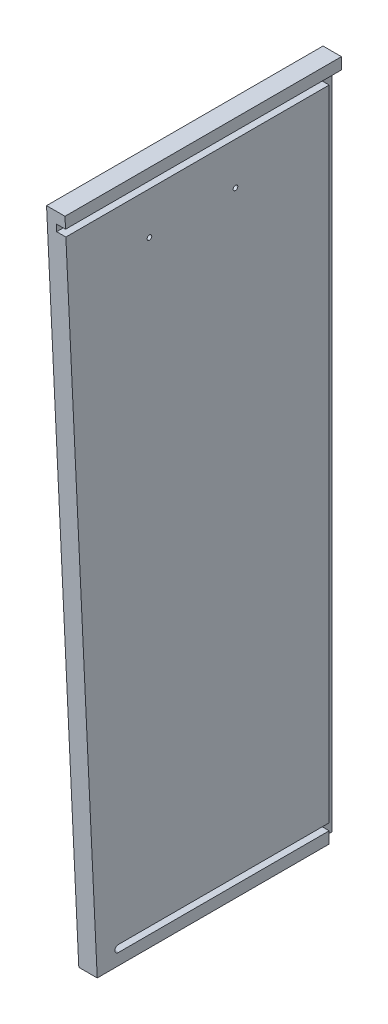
ISO-10303-21;
HEADER;
FILE_DESCRIPTION(('STEP AP214'),'2;1');
FILE_NAME('part.step','',(''),(''),'','','');
FILE_SCHEMA(('AUTOMOTIVE_DESIGN { 1 0 10303 214 1 1 1 1 }'));
ENDSEC;
DATA;
#1=APPLICATION_CONTEXT('core data for automotive mechanical design processes');
#2=APPLICATION_PROTOCOL_DEFINITION('international standard','automotive_design',2000,#1);
#3=PRODUCT_CONTEXT('',#1,'mechanical');
#4=PRODUCT('Part','Part','',(#3));
#5=PRODUCT_RELATED_PRODUCT_CATEGORY('part','',(#4));
#6=PRODUCT_DEFINITION_FORMATION('','',#4);
#7=PRODUCT_DEFINITION_CONTEXT('part definition',#1,'design');
#8=PRODUCT_DEFINITION('design','',#6,#7);
#9=PRODUCT_DEFINITION_SHAPE('','',#8);
#10=(LENGTH_UNIT() NAMED_UNIT(*) SI_UNIT(.MILLI.,.METRE.));
#11=(NAMED_UNIT(*) PLANE_ANGLE_UNIT() SI_UNIT($,.RADIAN.));
#12=(NAMED_UNIT(*) SI_UNIT($,.STERADIAN.) SOLID_ANGLE_UNIT());
#13=UNCERTAINTY_MEASURE_WITH_UNIT(LENGTH_MEASURE(1.E-05),#10,'distance_accuracy_value','');
#14=(GEOMETRIC_REPRESENTATION_CONTEXT(3) GLOBAL_UNCERTAINTY_ASSIGNED_CONTEXT((#13)) GLOBAL_UNIT_ASSIGNED_CONTEXT((#10,
#11,#12)) REPRESENTATION_CONTEXT('',''));
#15=CARTESIAN_POINT('',(0.,0.,0.));
#16=DIRECTION('',(0.,0.,1.));
#17=DIRECTION('',(1.,0.,0.));
#18=AXIS2_PLACEMENT_3D('',#15,#16,#17);
#19=CARTESIAN_POINT('',(19.05,0.,0.));
#20=DIRECTION('',(1.,0.,0.));
#21=DIRECTION('',(0.,0.,-1.));
#22=AXIS2_PLACEMENT_3D('',#19,#20,#21);
#23=PLANE('',#22);
#24=DIRECTION('',(0.,0.,1.));
#25=VECTOR('',#24,1.);
#26=CARTESIAN_POINT('',(19.05,-11.90625,0.));
#27=LINE('',#26,#25);
#28=CARTESIAN_POINT('',(19.05,-11.90625,0.));
#29=VERTEX_POINT('',#28);
#30=CARTESIAN_POINT('',(19.05,-11.90625,285.181747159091));
#31=VERTEX_POINT('',#30);
#32=EDGE_CURVE('E11',#29,#31,#27,.T.);
#33=ORIENTED_EDGE('',*,*,#32,.F.);
#34=DIRECTION('',(0.,1.,0.));
#35=VECTOR('',#34,1.);
#36=CARTESIAN_POINT('',(19.05,0.,0.));
#37=LINE('',#36,#35);
#38=CARTESIAN_POINT('',(19.05,0.,0.));
#39=VERTEX_POINT('',#38);
#40=EDGE_CURVE('E218',#29,#39,#37,.T.);
#41=ORIENTED_EDGE('',*,*,#40,.T.);
#42=DIRECTION('',(0.,0.,1.));
#43=VECTOR('',#42,1.);
#44=CARTESIAN_POINT('',(19.05,0.,0.));
#45=LINE('',#44,#43);
#46=CARTESIAN_POINT('',(19.05,0.,285.75));
#47=VERTEX_POINT('',#46);
#48=EDGE_CURVE('E208',#39,#47,#45,.T.);
#49=ORIENTED_EDGE('',*,*,#48,.T.);
#50=DIRECTION('',(0.,-0.998862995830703,-0.0476730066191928));
#51=VECTOR('',#50,1.);
#52=CARTESIAN_POINT('',(19.05,0.,285.75));
#53=LINE('',#52,#51);
#54=EDGE_CURVE('E213',#47,#31,#53,.T.);
#55=ORIENTED_EDGE('',*,*,#54,.T.);
#56=EDGE_LOOP('',(#33,#41,#49,#55));
#57=FACE_BOUND('',#56,.T.);
#58=ADVANCED_FACE('F33',(#57),#23,.T.);
#59=CARTESIAN_POINT('',(19.05,0.,0.));
#60=DIRECTION('',(0.,-1.,0.));
#61=DIRECTION('',(0.,0.,-1.));
#62=AXIS2_PLACEMENT_3D('',#59,#60,#61);
#63=PLANE('',#62);
#64=DIRECTION('',(0.,0.,1.));
#65=VECTOR('',#64,1.);
#66=CARTESIAN_POINT('',(0.,0.,0.));
#67=LINE('',#66,#65);
#68=CARTESIAN_POINT('',(0.,0.,0.));
#69=VERTEX_POINT('',#68);
#70=CARTESIAN_POINT('',(0.,0.,285.75));
#71=VERTEX_POINT('',#70);
#72=EDGE_CURVE('E207',#69,#71,#67,.T.);
#73=ORIENTED_EDGE('',*,*,#72,.T.);
#74=DIRECTION('',(-1.,0.,0.));
#75=VECTOR('',#74,1.);
#76=CARTESIAN_POINT('',(19.05,0.,285.75));
#77=LINE('',#76,#75);
#78=EDGE_CURVE('E234',#47,#71,#77,.T.);
#79=ORIENTED_EDGE('',*,*,#78,.F.);
#80=ORIENTED_EDGE('',*,*,#48,.F.);
#81=DIRECTION('',(-1.,0.,0.));
#82=VECTOR('',#81,1.);
#83=CARTESIAN_POINT('',(19.05,0.,0.));
#84=LINE('',#83,#82);
#85=EDGE_CURVE('E220',#39,#69,#84,.T.);
#86=ORIENTED_EDGE('',*,*,#85,.T.);
#87=EDGE_LOOP('',(#73,#79,#80,#86));
#88=FACE_BOUND('',#87,.T.);
#89=ADVANCED_FACE('F35',(#88),#63,.F.);
#90=CARTESIAN_POINT('',(19.05,0.,285.75));
#91=DIRECTION('',(0.,0.0476730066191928,-0.998862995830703));
#92=DIRECTION('',(0.,0.998862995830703,0.0476730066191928));
#93=AXIS2_PLACEMENT_3D('',#90,#91,#92);
#94=PLANE('',#93);
#95=DIRECTION('',(0.,0.998862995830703,0.0476730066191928));
#96=VECTOR('',#95,1.);
#97=CARTESIAN_POINT('',(9.525,0.,285.75));
#98=LINE('',#97,#96);
#99=CARTESIAN_POINT('',(9.525,-19.05,284.840795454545));
#100=VERTEX_POINT('',#99);
#101=CARTESIAN_POINT('',(9.525,-11.90625,285.181747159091));
#102=VERTEX_POINT('',#101);
#103=EDGE_CURVE('E204',#100,#102,#98,.T.);
#104=ORIENTED_EDGE('',*,*,#103,.T.);
#105=DIRECTION('',(1.,0.,0.));
#106=VECTOR('',#105,1.);
#107=CARTESIAN_POINT('',(19.05,-11.90625,285.181747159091));
#108=LINE('',#107,#106);
#109=EDGE_CURVE('E201',#102,#31,#108,.T.);
#110=ORIENTED_EDGE('',*,*,#109,.T.);
#111=ORIENTED_EDGE('',*,*,#54,.F.);
#112=ORIENTED_EDGE('',*,*,#78,.T.);
#113=DIRECTION('',(0.,-0.998862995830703,-0.0476730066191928));
#114=VECTOR('',#113,1.);
#115=CARTESIAN_POINT('',(0.,0.,285.75));
#116=LINE('',#115,#114);
#117=CARTESIAN_POINT('',(0.,-698.5,252.4125));
#118=VERTEX_POINT('',#117);
#119=EDGE_CURVE('E223',#71,#118,#116,.T.);
#120=ORIENTED_EDGE('',*,*,#119,.T.);
#121=DIRECTION('',(-1.,0.,0.));
#122=VECTOR('',#121,1.);
#123=CARTESIAN_POINT('',(19.05,-698.5,252.4125));
#124=LINE('',#123,#122);
#125=CARTESIAN_POINT('',(19.05,-698.5,252.4125));
#126=VERTEX_POINT('',#125);
#127=EDGE_CURVE('E231',#126,#118,#124,.T.);
#128=ORIENTED_EDGE('',*,*,#127,.F.);
#129=CARTESIAN_POINT('',(19.05,-19.05,284.840795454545));
#130=VERTEX_POINT('',#129);
#131=EDGE_CURVE('E211',#130,#126,#53,.T.);
#132=ORIENTED_EDGE('',*,*,#131,.F.);
#133=DIRECTION('',(-1.,0.,0.));
#134=VECTOR('',#133,1.);
#135=CARTESIAN_POINT('',(19.05,-19.05,284.840795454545));
#136=LINE('',#135,#134);
#137=EDGE_CURVE('E197',#130,#100,#136,.T.);
#138=ORIENTED_EDGE('',*,*,#137,.T.);
#139=EDGE_LOOP('',(#104,#110,#111,#112,#120,#128,#132,#138));
#140=FACE_BOUND('',#139,.T.);
#141=ADVANCED_FACE('F248',(#140),#94,.F.);
#142=CARTESIAN_POINT('',(19.05,-698.5,0.));
#143=DIRECTION('',(0.,1.,0.));
#144=DIRECTION('',(0.,0.,1.));
#145=AXIS2_PLACEMENT_3D('',#142,#143,#144);
#146=PLANE('',#145);
#147=DIRECTION('',(-1.,0.,0.));
#148=VECTOR('',#147,1.);
#149=CARTESIAN_POINT('',(19.05,-698.5,0.));
#150=LINE('',#149,#148);
#151=CARTESIAN_POINT('',(9.52499999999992,-698.5,0.));
#152=VERTEX_POINT('',#151);
#153=CARTESIAN_POINT('',(0.,-698.5,0.));
#154=VERTEX_POINT('',#153);
#155=EDGE_CURVE('E149',#152,#154,#150,.T.);
#156=ORIENTED_EDGE('',*,*,#155,.F.);
#157=DIRECTION('',(0.,0.,-1.));
#158=VECTOR('',#157,1.);
#159=CARTESIAN_POINT('',(9.52499999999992,-698.5,12.6999999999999));
#160=LINE('',#159,#158);
#161=CARTESIAN_POINT('',(9.52499999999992,-698.5,12.6999999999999));
#162=VERTEX_POINT('',#161);
#163=EDGE_CURVE('E133',#162,#152,#160,.T.);
#164=ORIENTED_EDGE('',*,*,#163,.F.);
#165=DIRECTION('',(-1.,0.,0.));
#166=VECTOR('',#165,1.);
#167=CARTESIAN_POINT('',(9.52499999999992,-698.5,12.6999999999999));
#168=LINE('',#167,#166);
#169=CARTESIAN_POINT('',(19.05,-698.5,12.6999999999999));
#170=VERTEX_POINT('',#169);
#171=EDGE_CURVE('E125',#170,#162,#168,.T.);
#172=ORIENTED_EDGE('',*,*,#171,.F.);
#173=DIRECTION('',(0.,0.,-1.));
#174=VECTOR('',#173,1.);
#175=CARTESIAN_POINT('',(19.05,-698.5,0.));
#176=LINE('',#175,#174);
#177=EDGE_CURVE('E216',#126,#170,#176,.T.);
#178=ORIENTED_EDGE('',*,*,#177,.F.);
#179=ORIENTED_EDGE('',*,*,#127,.T.);
#180=DIRECTION('',(0.,0.,-1.));
#181=VECTOR('',#180,1.);
#182=CARTESIAN_POINT('',(0.,-698.5,0.));
#183=LINE('',#182,#181);
#184=EDGE_CURVE('E225',#118,#154,#183,.T.);
#185=ORIENTED_EDGE('',*,*,#184,.T.);
#186=EDGE_LOOP('',(#156,#164,#172,#178,#179,#185));
#187=FACE_BOUND('',#186,.T.);
#188=ADVANCED_FACE('F147',(#187),#146,.F.);
#189=CARTESIAN_POINT('',(19.05,0.,0.));
#190=DIRECTION('',(0.,0.,1.));
#191=DIRECTION('',(0.,-1.,0.));
#192=AXIS2_PLACEMENT_3D('',#189,#190,#191);
#193=PLANE('',#192);
#194=DIRECTION('',(0.,1.,0.));
#195=VECTOR('',#194,1.);
#196=CARTESIAN_POINT('',(9.525,-11.90625,0.));
#197=LINE('',#196,#195);
#198=CARTESIAN_POINT('',(9.525,-11.90625,0.));
#199=VERTEX_POINT('',#198);
#200=EDGE_CURVE('E188',#152,#199,#197,.T.);
#201=ORIENTED_EDGE('',*,*,#200,.F.);
#202=ORIENTED_EDGE('',*,*,#155,.T.);
#203=DIRECTION('',(0.,1.,0.));
#204=VECTOR('',#203,1.);
#205=CARTESIAN_POINT('',(0.,0.,0.));
#206=LINE('',#205,#204);
#207=EDGE_CURVE('E212',#154,#69,#206,.T.);
#208=ORIENTED_EDGE('',*,*,#207,.T.);
#209=ORIENTED_EDGE('',*,*,#85,.F.);
#210=ORIENTED_EDGE('',*,*,#40,.F.);
#211=DIRECTION('',(1.,0.,0.));
#212=VECTOR('',#211,1.);
#213=CARTESIAN_POINT('',(19.05,-11.90625,0.));
#214=LINE('',#213,#212);
#215=EDGE_CURVE('E192',#199,#29,#214,.T.);
#216=ORIENTED_EDGE('',*,*,#215,.F.);
#217=EDGE_LOOP('',(#201,#202,#208,#209,#210,#216));
#218=FACE_BOUND('',#217,.T.);
#219=ADVANCED_FACE('F277',(#218),#193,.F.);
#220=DIRECTION('',(0.,-1.,0.));
#221=VECTOR('',#220,1.);
#222=CARTESIAN_POINT('',(19.05,0.,12.7));
#223=LINE('',#222,#221);
#224=CARTESIAN_POINT('',(19.05,-19.05,12.7));
#225=VERTEX_POINT('',#224);
#226=CARTESIAN_POINT('',(19.05,-679.45,12.6999999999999));
#227=VERTEX_POINT('',#226);
#228=EDGE_CURVE('E48',#225,#227,#223,.T.);
#229=ORIENTED_EDGE('',*,*,#228,.F.);
#230=DIRECTION('',(0.,0.,-1.));
#231=VECTOR('',#230,1.);
#232=CARTESIAN_POINT('',(19.05,-19.05,0.));
#233=LINE('',#232,#231);
#234=EDGE_CURVE('E41',#130,#225,#233,.T.);
#235=ORIENTED_EDGE('',*,*,#234,.F.);
#236=ORIENTED_EDGE('',*,*,#131,.T.);
#237=ORIENTED_EDGE('',*,*,#177,.T.);
#238=CARTESIAN_POINT('',(19.05,-686.59375,12.6999999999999));
#239=VERTEX_POINT('',#238);
#240=EDGE_CURVE('E128',#239,#170,#223,.T.);
#241=ORIENTED_EDGE('',*,*,#240,.F.);
#242=DIRECTION('',(0.,0.,-1.));
#243=VECTOR('',#242,1.);
#244=CARTESIAN_POINT('',(19.05,-686.59375,0.));
#245=LINE('',#244,#243);
#246=CARTESIAN_POINT('',(19.05,-686.59375,230.539925));
#247=VERTEX_POINT('',#246);
#248=EDGE_CURVE('E176',#247,#239,#245,.T.);
#249=ORIENTED_EDGE('',*,*,#248,.F.);
#250=CARTESIAN_POINT('',(19.05,-683.021875,230.539925));
#251=DIRECTION('',(1.,0.,0.));
#252=DIRECTION('',(0.,0.,-1.));
#253=AXIS2_PLACEMENT_3D('',#250,#251,#252);
#254=CIRCLE('',#253,3.571875);
#255=CARTESIAN_POINT('',(19.05,-679.45,230.539925));
#256=VERTEX_POINT('',#255);
#257=EDGE_CURVE('E181',#256,#247,#254,.T.);
#258=ORIENTED_EDGE('',*,*,#257,.F.);
#259=DIRECTION('',(0.,0.,1.));
#260=VECTOR('',#259,1.);
#261=CARTESIAN_POINT('',(19.05,-679.45,0.));
#262=LINE('',#261,#260);
#263=EDGE_CURVE('E170',#227,#256,#262,.T.);
#264=ORIENTED_EDGE('',*,*,#263,.F.);
#265=EDGE_LOOP('',(#229,#235,#236,#237,#241,#249,#258,#264));
#266=FACE_BOUND('',#265,.T.);
#267=CARTESIAN_POINT('',(19.05,-62.70625,109.5375));
#268=DIRECTION('',(-1.,0.,0.));
#269=DIRECTION('',(0.,0.,1.));
#270=AXIS2_PLACEMENT_3D('',#267,#268,#269);
#271=CIRCLE('',#270,2.38125);
#272=CARTESIAN_POINT('',(19.05,-62.70625,111.91875));
#273=VERTEX_POINT('',#272);
#274=EDGE_CURVE('E160',#273,#273,#271,.T.);
#275=ORIENTED_EDGE('',*,*,#274,.T.);
#276=EDGE_LOOP('',(#275));
#277=FACE_BOUND('',#276,.T.);
#278=CARTESIAN_POINT('',(19.05,-62.70625,198.4375));
#279=DIRECTION('',(-1.,0.,0.));
#280=DIRECTION('',(0.,0.,1.));
#281=AXIS2_PLACEMENT_3D('',#278,#279,#280);
#282=CIRCLE('',#281,2.38125);
#283=CARTESIAN_POINT('',(19.05,-62.70625,200.81875));
#284=VERTEX_POINT('',#283);
#285=EDGE_CURVE('E167',#284,#284,#282,.T.);
#286=ORIENTED_EDGE('',*,*,#285,.T.);
#287=EDGE_LOOP('',(#286));
#288=FACE_BOUND('',#287,.T.);
#289=ADVANCED_FACE('F243',(#266,#277,#288),#23,.T.);
#290=CARTESIAN_POINT('',(0.,0.,0.));
#291=DIRECTION('',(1.,0.,0.));
#292=DIRECTION('',(0.,0.,-1.));
#293=AXIS2_PLACEMENT_3D('',#290,#291,#292);
#294=PLANE('',#293);
#295=CARTESIAN_POINT('',(0.,-62.70625,109.5375));
#296=DIRECTION('',(-1.,0.,0.));
#297=DIRECTION('',(0.,0.,1.));
#298=AXIS2_PLACEMENT_3D('',#295,#296,#297);
#299=CIRCLE('',#298,2.38125);
#300=CARTESIAN_POINT('',(0.,-62.70625,111.91875));
#301=VERTEX_POINT('',#300);
#302=EDGE_CURVE('E164',#301,#301,#299,.T.);
#303=ORIENTED_EDGE('',*,*,#302,.F.);
#304=EDGE_LOOP('',(#303));
#305=FACE_BOUND('',#304,.T.);
#306=CARTESIAN_POINT('',(0.,-62.70625,198.4375));
#307=DIRECTION('',(-1.,0.,0.));
#308=DIRECTION('',(0.,0.,1.));
#309=AXIS2_PLACEMENT_3D('',#306,#307,#308);
#310=CIRCLE('',#309,2.38125);
#311=CARTESIAN_POINT('',(0.,-62.70625,200.81875));
#312=VERTEX_POINT('',#311);
#313=EDGE_CURVE('E163',#312,#312,#310,.T.);
#314=ORIENTED_EDGE('',*,*,#313,.F.);
#315=EDGE_LOOP('',(#314));
#316=FACE_BOUND('',#315,.T.);
#317=ORIENTED_EDGE('',*,*,#72,.F.);
#318=ORIENTED_EDGE('',*,*,#207,.F.);
#319=ORIENTED_EDGE('',*,*,#184,.F.);
#320=ORIENTED_EDGE('',*,*,#119,.F.);
#321=EDGE_LOOP('',(#317,#318,#319,#320));
#322=FACE_BOUND('',#321,.T.);
#323=ADVANCED_FACE('F275',(#305,#316,#322),#294,.F.);
#324=CARTESIAN_POINT('',(9.525,-11.90625,285.75));
#325=DIRECTION('',(-1.,0.,0.));
#326=DIRECTION('',(0.,-1.,0.));
#327=AXIS2_PLACEMENT_3D('',#324,#325,#326);
#328=PLANE('',#327);
#329=DIRECTION('',(0.,0.,-1.));
#330=VECTOR('',#329,1.);
#331=CARTESIAN_POINT('',(9.525,-19.05,285.75));
#332=LINE('',#331,#330);
#333=CARTESIAN_POINT('',(9.525,-19.05,12.7));
#334=VERTEX_POINT('',#333);
#335=EDGE_CURVE('E194',#100,#334,#332,.T.);
#336=ORIENTED_EDGE('',*,*,#335,.T.);
#337=DIRECTION('',(0.,1.,0.));
#338=VECTOR('',#337,1.);
#339=CARTESIAN_POINT('',(9.525,-11.90625,12.7));
#340=LINE('',#339,#338);
#341=CARTESIAN_POINT('',(9.52499999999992,-679.45,12.6999999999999));
#342=VERTEX_POINT('',#341);
#343=EDGE_CURVE('E145',#342,#334,#340,.T.);
#344=ORIENTED_EDGE('',*,*,#343,.F.);
#345=DIRECTION('',(0.,0.,1.));
#346=VECTOR('',#345,1.);
#347=CARTESIAN_POINT('',(9.525,-679.45,0.));
#348=LINE('',#347,#346);
#349=CARTESIAN_POINT('',(9.525,-679.45,230.539925));
#350=VERTEX_POINT('',#349);
#351=EDGE_CURVE('E173',#342,#350,#348,.T.);
#352=ORIENTED_EDGE('',*,*,#351,.T.);
#353=CARTESIAN_POINT('',(9.525,-683.021875,230.539925));
#354=DIRECTION('',(1.,0.,0.));
#355=DIRECTION('',(0.,0.,-1.));
#356=AXIS2_PLACEMENT_3D('',#353,#354,#355);
#357=CIRCLE('',#356,3.571875);
#358=CARTESIAN_POINT('',(9.525,-686.59375,230.539925));
#359=VERTEX_POINT('',#358);
#360=EDGE_CURVE('E175',#350,#359,#357,.T.);
#361=ORIENTED_EDGE('',*,*,#360,.T.);
#362=DIRECTION('',(0.,0.,-1.));
#363=VECTOR('',#362,1.);
#364=CARTESIAN_POINT('',(9.525,-686.59375,0.));
#365=LINE('',#364,#363);
#366=CARTESIAN_POINT('',(9.525,-686.59375,12.6999999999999));
#367=VERTEX_POINT('',#366);
#368=EDGE_CURVE('E144',#359,#367,#365,.T.);
#369=ORIENTED_EDGE('',*,*,#368,.T.);
#370=EDGE_CURVE('E56',#162,#367,#340,.T.);
#371=ORIENTED_EDGE('',*,*,#370,.F.);
#372=ORIENTED_EDGE('',*,*,#163,.T.);
#373=ORIENTED_EDGE('',*,*,#200,.T.);
#374=DIRECTION('',(0.,0.,-1.));
#375=VECTOR('',#374,1.);
#376=CARTESIAN_POINT('',(9.525,-11.90625,285.75));
#377=LINE('',#376,#375);
#378=EDGE_CURVE('E195',#102,#199,#377,.T.);
#379=ORIENTED_EDGE('',*,*,#378,.F.);
#380=ORIENTED_EDGE('',*,*,#103,.F.);
#381=EDGE_LOOP('',(#336,#344,#352,#361,#369,#371,#372,#373,#379,#380));
#382=FACE_BOUND('',#381,.T.);
#383=ADVANCED_FACE('F139',(#382),#328,.F.);
#384=CARTESIAN_POINT('',(19.05,-11.90625,285.75));
#385=DIRECTION('',(0.,1.,0.));
#386=DIRECTION('',(-1.,0.,0.));
#387=AXIS2_PLACEMENT_3D('',#384,#385,#386);
#388=PLANE('',#387);
#389=ORIENTED_EDGE('',*,*,#378,.T.);
#390=ORIENTED_EDGE('',*,*,#215,.T.);
#391=ORIENTED_EDGE('',*,*,#32,.T.);
#392=ORIENTED_EDGE('',*,*,#109,.F.);
#393=EDGE_LOOP('',(#389,#390,#391,#392));
#394=FACE_BOUND('',#393,.T.);
#395=ADVANCED_FACE('F279',(#394),#388,.F.);
#396=CARTESIAN_POINT('',(19.05,-19.05,285.75));
#397=DIRECTION('',(0.,-1.,0.));
#398=DIRECTION('',(0.,0.,-1.));
#399=AXIS2_PLACEMENT_3D('',#396,#397,#398);
#400=PLANE('',#399);
#401=ORIENTED_EDGE('',*,*,#234,.T.);
#402=DIRECTION('',(-1.,0.,0.));
#403=VECTOR('',#402,1.);
#404=CARTESIAN_POINT('',(19.05,-19.05,12.7));
#405=LINE('',#404,#403);
#406=EDGE_CURVE('E155',#225,#334,#405,.T.);
#407=ORIENTED_EDGE('',*,*,#406,.T.);
#408=ORIENTED_EDGE('',*,*,#335,.F.);
#409=ORIENTED_EDGE('',*,*,#137,.F.);
#410=EDGE_LOOP('',(#401,#407,#408,#409));
#411=FACE_BOUND('',#410,.T.);
#412=ADVANCED_FACE('F239',(#411),#400,.F.);
#413=CARTESIAN_POINT('',(9.525,-686.59375,0.));
#414=DIRECTION('',(0.,-1.,0.));
#415=DIRECTION('',(0.,0.,-1.));
#416=AXIS2_PLACEMENT_3D('',#413,#414,#415);
#417=PLANE('',#416);
#418=ORIENTED_EDGE('',*,*,#248,.T.);
#419=DIRECTION('',(-1.,0.,0.));
#420=VECTOR('',#419,1.);
#421=CARTESIAN_POINT('',(9.525,-686.59375,12.6999999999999));
#422=LINE('',#421,#420);
#423=EDGE_CURVE('E158',#239,#367,#422,.T.);
#424=ORIENTED_EDGE('',*,*,#423,.T.);
#425=ORIENTED_EDGE('',*,*,#368,.F.);
#426=DIRECTION('',(1.,0.,0.));
#427=VECTOR('',#426,1.);
#428=CARTESIAN_POINT('',(9.525,-686.59375,230.539925));
#429=LINE('',#428,#427);
#430=EDGE_CURVE('E186',#359,#247,#429,.T.);
#431=ORIENTED_EDGE('',*,*,#430,.T.);
#432=EDGE_LOOP('',(#418,#424,#425,#431));
#433=FACE_BOUND('',#432,.T.);
#434=ADVANCED_FACE('F253',(#433),#417,.F.);
#435=CARTESIAN_POINT('',(9.525,-683.021875,230.539925));
#436=DIRECTION('',(1.,0.,0.));
#437=DIRECTION('',(0.,0.,-1.));
#438=AXIS2_PLACEMENT_3D('',#435,#436,#437);
#439=CYLINDRICAL_SURFACE('',#438,3.571875);
#440=ORIENTED_EDGE('',*,*,#257,.T.);
#441=ORIENTED_EDGE('',*,*,#430,.F.);
#442=ORIENTED_EDGE('',*,*,#360,.F.);
#443=DIRECTION('',(1.,0.,0.));
#444=VECTOR('',#443,1.);
#445=CARTESIAN_POINT('',(9.525,-679.45,230.539925));
#446=LINE('',#445,#444);
#447=EDGE_CURVE('E179',#350,#256,#446,.T.);
#448=ORIENTED_EDGE('',*,*,#447,.T.);
#449=EDGE_LOOP('',(#440,#441,#442,#448));
#450=FACE_BOUND('',#449,.T.);
#451=ADVANCED_FACE('F256',(#450),#439,.F.);
#452=CARTESIAN_POINT('',(9.525,-679.45,0.));
#453=DIRECTION('',(0.,1.,0.));
#454=DIRECTION('',(0.,0.,1.));
#455=AXIS2_PLACEMENT_3D('',#452,#453,#454);
#456=PLANE('',#455);
#457=ORIENTED_EDGE('',*,*,#351,.F.);
#458=DIRECTION('',(1.,0.,0.));
#459=VECTOR('',#458,1.);
#460=CARTESIAN_POINT('',(9.525,-679.45,12.6999999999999));
#461=LINE('',#460,#459);
#462=EDGE_CURVE('E150',#342,#227,#461,.T.);
#463=ORIENTED_EDGE('',*,*,#462,.T.);
#464=ORIENTED_EDGE('',*,*,#263,.T.);
#465=ORIENTED_EDGE('',*,*,#447,.F.);
#466=EDGE_LOOP('',(#457,#463,#464,#465));
#467=FACE_BOUND('',#466,.T.);
#468=ADVANCED_FACE('F260',(#467),#456,.F.);
#469=CARTESIAN_POINT('',(19.05,-62.70625,198.4375));
#470=DIRECTION('',(-1.,0.,0.));
#471=DIRECTION('',(0.,0.,1.));
#472=AXIS2_PLACEMENT_3D('',#469,#470,#471);
#473=CYLINDRICAL_SURFACE('',#472,2.38125);
#474=CARTESIAN_POINT('',(19.05,-62.70625,200.81875));
#475=CARTESIAN_POINT('',(18.8515625,-62.70625,200.81875));
#476=CARTESIAN_POINT('',(18.653125,-62.70625,200.81875));
#477=CARTESIAN_POINT('',(18.25625,-62.70625,200.81875));
#478=CARTESIAN_POINT('',(18.0578125,-62.70625,200.81875));
#479=CARTESIAN_POINT('',(17.6609375,-62.70625,200.81875));
#480=CARTESIAN_POINT('',(17.4625,-62.70625,200.81875));
#481=CARTESIAN_POINT('',(17.065625,-62.70625,200.81875));
#482=CARTESIAN_POINT('',(16.8671875,-62.70625,200.81875));
#483=CARTESIAN_POINT('',(16.4703125,-62.70625,200.81875));
#484=CARTESIAN_POINT('',(16.271875,-62.70625,200.81875));
#485=CARTESIAN_POINT('',(15.875,-62.70625,200.81875));
#486=CARTESIAN_POINT('',(15.6765625,-62.70625,200.81875));
#487=CARTESIAN_POINT('',(15.2796875,-62.70625,200.81875));
#488=CARTESIAN_POINT('',(15.08125,-62.70625,200.81875));
#489=CARTESIAN_POINT('',(14.684375,-62.70625,200.81875));
#490=CARTESIAN_POINT('',(14.4859375,-62.70625,200.81875));
#491=CARTESIAN_POINT('',(14.0890625,-62.70625,200.81875));
#492=CARTESIAN_POINT('',(13.890625,-62.70625,200.81875));
#493=CARTESIAN_POINT('',(13.49375,-62.70625,200.81875));
#494=CARTESIAN_POINT('',(13.2953125,-62.70625,200.81875));
#495=CARTESIAN_POINT('',(12.8984375,-62.70625,200.81875));
#496=CARTESIAN_POINT('',(12.7,-62.70625,200.81875));
#497=CARTESIAN_POINT('',(12.303125,-62.70625,200.81875));
#498=CARTESIAN_POINT('',(12.1046875,-62.70625,200.81875));
#499=CARTESIAN_POINT('',(11.7078125,-62.70625,200.81875));
#500=CARTESIAN_POINT('',(11.509375,-62.70625,200.81875));
#501=CARTESIAN_POINT('',(11.1125,-62.70625,200.81875));
#502=CARTESIAN_POINT('',(10.9140625,-62.70625,200.81875));
#503=CARTESIAN_POINT('',(10.5171875,-62.70625,200.81875));
#504=CARTESIAN_POINT('',(10.31875,-62.70625,200.81875));
#505=CARTESIAN_POINT('',(9.921875,-62.70625,200.81875));
#506=CARTESIAN_POINT('',(9.7234375,-62.70625,200.81875));
#507=CARTESIAN_POINT('',(9.3265625,-62.70625,200.81875));
#508=CARTESIAN_POINT('',(9.128125,-62.70625,200.81875));
#509=CARTESIAN_POINT('',(8.73125,-62.70625,200.81875));
#510=CARTESIAN_POINT('',(8.5328125,-62.70625,200.81875));
#511=CARTESIAN_POINT('',(8.1359375,-62.70625,200.81875));
#512=CARTESIAN_POINT('',(7.9375,-62.70625,200.81875));
#513=CARTESIAN_POINT('',(7.540625,-62.70625,200.81875));
#514=CARTESIAN_POINT('',(7.3421875,-62.70625,200.81875));
#515=CARTESIAN_POINT('',(6.9453125,-62.70625,200.81875));
#516=CARTESIAN_POINT('',(6.746875,-62.70625,200.81875));
#517=CARTESIAN_POINT('',(6.35,-62.70625,200.81875));
#518=CARTESIAN_POINT('',(6.1515625,-62.70625,200.81875));
#519=CARTESIAN_POINT('',(5.7546875,-62.70625,200.81875));
#520=CARTESIAN_POINT('',(5.55625,-62.70625,200.81875));
#521=CARTESIAN_POINT('',(5.159375,-62.70625,200.81875));
#522=CARTESIAN_POINT('',(4.9609375,-62.70625,200.81875));
#523=CARTESIAN_POINT('',(4.5640625,-62.70625,200.81875));
#524=CARTESIAN_POINT('',(4.365625,-62.70625,200.81875));
#525=CARTESIAN_POINT('',(3.96875,-62.70625,200.81875));
#526=CARTESIAN_POINT('',(3.7703125,-62.70625,200.81875));
#527=CARTESIAN_POINT('',(3.3734375,-62.70625,200.81875));
#528=CARTESIAN_POINT('',(3.175,-62.70625,200.81875));
#529=CARTESIAN_POINT('',(2.778125,-62.70625,200.81875));
#530=CARTESIAN_POINT('',(2.5796875,-62.70625,200.81875));
#531=CARTESIAN_POINT('',(2.1828125,-62.70625,200.81875));
#532=CARTESIAN_POINT('',(1.984375,-62.70625,200.81875));
#533=CARTESIAN_POINT('',(1.5875,-62.70625,200.81875));
#534=CARTESIAN_POINT('',(1.3890625,-62.70625,200.81875));
#535=CARTESIAN_POINT('',(0.992187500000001,-62.70625,200.81875));
#536=CARTESIAN_POINT('',(0.793750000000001,-62.70625,200.81875));
#537=CARTESIAN_POINT('',(0.396875,-62.70625,200.81875));
#538=CARTESIAN_POINT('',(0.1984375,-62.70625,200.81875));
#539=CARTESIAN_POINT('',(0.,-62.70625,200.81875));
#540=B_SPLINE_CURVE_WITH_KNOTS('',3,(#474,#475,#476,#477,#478,#479,#480,#481,#482,#483,#484,
#485,#486,#487,#488,#489,#490,#491,#492,#493,#494,#495,#496,#497,#498,#499,#500,#501,#502,#503,
#504,#505,#506,#507,#508,#509,#510,#511,#512,#513,#514,#515,#516,#517,#518,#519,#520,#521,#522,
#523,#524,#525,#526,#527,#528,#529,#530,#531,#532,#533,#534,#535,#536,#537,#538,#539),
.UNSPECIFIED.,.F.,.F.,(4,2,2,2,2,2,2,2,2,2,2,2,2,2,2,2,2,2,2,2,2,2,2,2,2,2,2,2,2,2,2,2,4),(0.,
0.595312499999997,1.190625,1.7859375,2.38125,2.9765625,3.571875,4.1671875,4.7625,5.3578125,
5.953125,6.5484375,7.14375,7.7390625,8.334375,8.9296875,9.525,10.1203125,10.715625,11.3109375,
11.90625,12.5015625,13.096875,13.6921875,14.2875,14.8828125,15.478125,16.0734375,16.66875,
17.2640625,17.859375,18.4546875,19.05),.UNSPECIFIED.);
#541=EDGE_CURVE('BSEAM366',#284,#312,#540,.T.);
#542=ORIENTED_EDGE('',*,*,#285,.F.);
#543=ORIENTED_EDGE('',*,*,#313,.T.);
#544=ORIENTED_EDGE('',*,*,#541,.T.);
#545=ORIENTED_EDGE('',*,*,#541,.F.);
#546=EDGE_LOOP('',(#542,#544,#543,#545));
#547=FACE_BOUND('',#546,.T.);
#548=ADVANCED_FACE('F366',(#547),#473,.F.);
#549=CARTESIAN_POINT('',(19.05,-62.70625,109.5375));
#550=DIRECTION('',(-1.,0.,0.));
#551=DIRECTION('',(0.,0.,1.));
#552=AXIS2_PLACEMENT_3D('',#549,#550,#551);
#553=CYLINDRICAL_SURFACE('',#552,2.38125);
#554=CARTESIAN_POINT('',(19.05,-62.70625,111.91875));
#555=CARTESIAN_POINT('',(18.8515625,-62.70625,111.91875));
#556=CARTESIAN_POINT('',(18.653125,-62.70625,111.91875));
#557=CARTESIAN_POINT('',(18.25625,-62.70625,111.91875));
#558=CARTESIAN_POINT('',(18.0578125,-62.70625,111.91875));
#559=CARTESIAN_POINT('',(17.6609375,-62.70625,111.91875));
#560=CARTESIAN_POINT('',(17.4625,-62.70625,111.91875));
#561=CARTESIAN_POINT('',(17.065625,-62.70625,111.91875));
#562=CARTESIAN_POINT('',(16.8671875,-62.70625,111.91875));
#563=CARTESIAN_POINT('',(16.4703125,-62.70625,111.91875));
#564=CARTESIAN_POINT('',(16.271875,-62.70625,111.91875));
#565=CARTESIAN_POINT('',(15.875,-62.70625,111.91875));
#566=CARTESIAN_POINT('',(15.6765625,-62.70625,111.91875));
#567=CARTESIAN_POINT('',(15.2796875,-62.70625,111.91875));
#568=CARTESIAN_POINT('',(15.08125,-62.70625,111.91875));
#569=CARTESIAN_POINT('',(14.684375,-62.70625,111.91875));
#570=CARTESIAN_POINT('',(14.4859375,-62.70625,111.91875));
#571=CARTESIAN_POINT('',(14.0890625,-62.70625,111.91875));
#572=CARTESIAN_POINT('',(13.890625,-62.70625,111.91875));
#573=CARTESIAN_POINT('',(13.49375,-62.70625,111.91875));
#574=CARTESIAN_POINT('',(13.2953125,-62.70625,111.91875));
#575=CARTESIAN_POINT('',(12.8984375,-62.70625,111.91875));
#576=CARTESIAN_POINT('',(12.7,-62.70625,111.91875));
#577=CARTESIAN_POINT('',(12.303125,-62.70625,111.91875));
#578=CARTESIAN_POINT('',(12.1046875,-62.70625,111.91875));
#579=CARTESIAN_POINT('',(11.7078125,-62.70625,111.91875));
#580=CARTESIAN_POINT('',(11.509375,-62.70625,111.91875));
#581=CARTESIAN_POINT('',(11.1125,-62.70625,111.91875));
#582=CARTESIAN_POINT('',(10.9140625,-62.70625,111.91875));
#583=CARTESIAN_POINT('',(10.5171875,-62.70625,111.91875));
#584=CARTESIAN_POINT('',(10.31875,-62.70625,111.91875));
#585=CARTESIAN_POINT('',(9.921875,-62.70625,111.91875));
#586=CARTESIAN_POINT('',(9.7234375,-62.70625,111.91875));
#587=CARTESIAN_POINT('',(9.3265625,-62.70625,111.91875));
#588=CARTESIAN_POINT('',(9.128125,-62.70625,111.91875));
#589=CARTESIAN_POINT('',(8.73125,-62.70625,111.91875));
#590=CARTESIAN_POINT('',(8.5328125,-62.70625,111.91875));
#591=CARTESIAN_POINT('',(8.1359375,-62.70625,111.91875));
#592=CARTESIAN_POINT('',(7.9375,-62.70625,111.91875));
#593=CARTESIAN_POINT('',(7.540625,-62.70625,111.91875));
#594=CARTESIAN_POINT('',(7.3421875,-62.70625,111.91875));
#595=CARTESIAN_POINT('',(6.9453125,-62.70625,111.91875));
#596=CARTESIAN_POINT('',(6.746875,-62.70625,111.91875));
#597=CARTESIAN_POINT('',(6.35,-62.70625,111.91875));
#598=CARTESIAN_POINT('',(6.1515625,-62.70625,111.91875));
#599=CARTESIAN_POINT('',(5.7546875,-62.70625,111.91875));
#600=CARTESIAN_POINT('',(5.55625,-62.70625,111.91875));
#601=CARTESIAN_POINT('',(5.159375,-62.70625,111.91875));
#602=CARTESIAN_POINT('',(4.9609375,-62.70625,111.91875));
#603=CARTESIAN_POINT('',(4.5640625,-62.70625,111.91875));
#604=CARTESIAN_POINT('',(4.365625,-62.70625,111.91875));
#605=CARTESIAN_POINT('',(3.96875,-62.70625,111.91875));
#606=CARTESIAN_POINT('',(3.7703125,-62.70625,111.91875));
#607=CARTESIAN_POINT('',(3.3734375,-62.70625,111.91875));
#608=CARTESIAN_POINT('',(3.175,-62.70625,111.91875));
#609=CARTESIAN_POINT('',(2.778125,-62.70625,111.91875));
#610=CARTESIAN_POINT('',(2.5796875,-62.70625,111.91875));
#611=CARTESIAN_POINT('',(2.1828125,-62.70625,111.91875));
#612=CARTESIAN_POINT('',(1.984375,-62.70625,111.91875));
#613=CARTESIAN_POINT('',(1.5875,-62.70625,111.91875));
#614=CARTESIAN_POINT('',(1.3890625,-62.70625,111.91875));
#615=CARTESIAN_POINT('',(0.992187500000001,-62.70625,111.91875));
#616=CARTESIAN_POINT('',(0.793750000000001,-62.70625,111.91875));
#617=CARTESIAN_POINT('',(0.396875,-62.70625,111.91875));
#618=CARTESIAN_POINT('',(0.1984375,-62.70625,111.91875));
#619=CARTESIAN_POINT('',(0.,-62.70625,111.91875));
#620=B_SPLINE_CURVE_WITH_KNOTS('',3,(#554,#555,#556,#557,#558,#559,#560,#561,#562,#563,#564,
#565,#566,#567,#568,#569,#570,#571,#572,#573,#574,#575,#576,#577,#578,#579,#580,#581,#582,#583,
#584,#585,#586,#587,#588,#589,#590,#591,#592,#593,#594,#595,#596,#597,#598,#599,#600,#601,#602,
#603,#604,#605,#606,#607,#608,#609,#610,#611,#612,#613,#614,#615,#616,#617,#618,#619),
.UNSPECIFIED.,.F.,.F.,(4,2,2,2,2,2,2,2,2,2,2,2,2,2,2,2,2,2,2,2,2,2,2,2,2,2,2,2,2,2,2,2,4),(0.,
0.595312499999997,1.190625,1.7859375,2.38125,2.9765625,3.571875,4.1671875,4.7625,5.3578125,
5.953125,6.5484375,7.14375,7.7390625,8.334375,8.9296875,9.525,10.1203125,10.715625,11.3109375,
11.90625,12.5015625,13.096875,13.6921875,14.2875,14.8828125,15.478125,16.0734375,16.66875,
17.2640625,17.859375,18.4546875,19.05),.UNSPECIFIED.);
#621=EDGE_CURVE('BSEAM375',#273,#301,#620,.T.);
#622=ORIENTED_EDGE('',*,*,#274,.F.);
#623=ORIENTED_EDGE('',*,*,#302,.T.);
#624=ORIENTED_EDGE('',*,*,#621,.T.);
#625=ORIENTED_EDGE('',*,*,#621,.F.);
#626=EDGE_LOOP('',(#622,#624,#623,#625));
#627=FACE_BOUND('',#626,.T.);
#628=ADVANCED_FACE('F375',(#627),#553,.F.);
#629=CARTESIAN_POINT('',(0.,0.,12.7));
#630=DIRECTION('',(0.,0.,1.));
#631=DIRECTION('',(0.,-1.,0.));
#632=AXIS2_PLACEMENT_3D('',#629,#630,#631);
#633=PLANE('',#632);
#634=ORIENTED_EDGE('',*,*,#228,.T.);
#635=ORIENTED_EDGE('',*,*,#462,.F.);
#636=ORIENTED_EDGE('',*,*,#343,.T.);
#637=ORIENTED_EDGE('',*,*,#406,.F.);
#638=EDGE_LOOP('',(#634,#635,#636,#637));
#639=FACE_BOUND('',#638,.T.);
#640=ADVANCED_FACE('F262',(#639),#633,.F.);
#641=ORIENTED_EDGE('',*,*,#240,.T.);
#642=ORIENTED_EDGE('',*,*,#171,.T.);
#643=ORIENTED_EDGE('',*,*,#370,.T.);
#644=ORIENTED_EDGE('',*,*,#423,.F.);
#645=EDGE_LOOP('',(#641,#642,#643,#644));
#646=FACE_BOUND('',#645,.T.);
#647=ADVANCED_FACE('F126',(#646),#633,.F.);
#648=CLOSED_SHELL('',(#58,#89,#141,#188,#219,#289,#323,#383,#395,#412,#434,#451,#468,#548,#628,
#640,#647));
#649=MANIFOLD_SOLID_BREP('B2',#648);
#650=ADVANCED_BREP_SHAPE_REPRESENTATION('',(#18,#649),#14);
#651=SHAPE_DEFINITION_REPRESENTATION(#9,#650);
ENDSEC;
END-ISO-10303-21;
